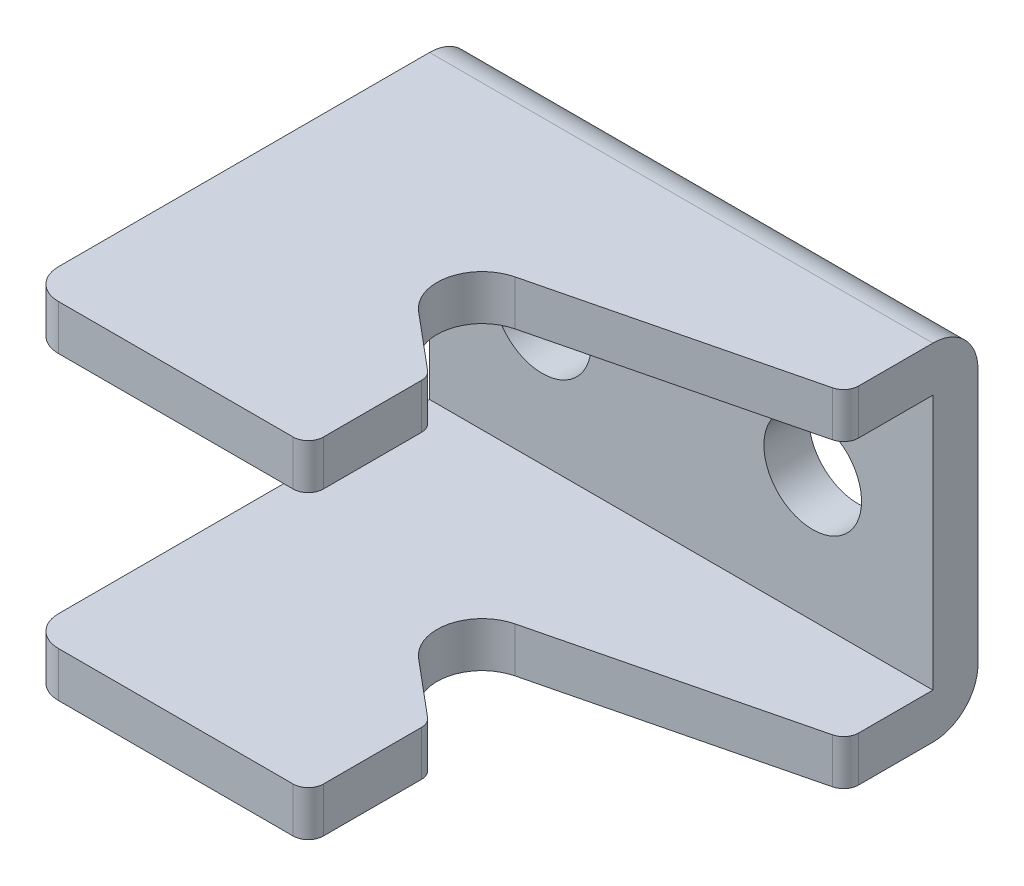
ISO-10303-21;
HEADER;
FILE_DESCRIPTION(('STEP AP214'),'2;1');
FILE_NAME('part.step','',(''),(''),'','','');
FILE_SCHEMA(('AUTOMOTIVE_DESIGN { 1 0 10303 214 1 1 1 1 }'));
ENDSEC;
DATA;
#1=APPLICATION_CONTEXT('core data for automotive mechanical design processes');
#2=APPLICATION_PROTOCOL_DEFINITION('international standard','automotive_design',2000,#1);
#3=PRODUCT_CONTEXT('',#1,'mechanical');
#4=PRODUCT('Part','Part','',(#3));
#5=PRODUCT_RELATED_PRODUCT_CATEGORY('part','',(#4));
#6=PRODUCT_DEFINITION_FORMATION('','',#4);
#7=PRODUCT_DEFINITION_CONTEXT('part definition',#1,'design');
#8=PRODUCT_DEFINITION('design','',#6,#7);
#9=PRODUCT_DEFINITION_SHAPE('','',#8);
#10=(LENGTH_UNIT() NAMED_UNIT(*) SI_UNIT(.MILLI.,.METRE.));
#11=(NAMED_UNIT(*) PLANE_ANGLE_UNIT() SI_UNIT($,.RADIAN.));
#12=(NAMED_UNIT(*) SI_UNIT($,.STERADIAN.) SOLID_ANGLE_UNIT());
#13=UNCERTAINTY_MEASURE_WITH_UNIT(LENGTH_MEASURE(1.E-05),#10,'distance_accuracy_value','');
#14=(GEOMETRIC_REPRESENTATION_CONTEXT(3) GLOBAL_UNCERTAINTY_ASSIGNED_CONTEXT((#13)) GLOBAL_UNIT_ASSIGNED_CONTEXT((#10,
#11,#12)) REPRESENTATION_CONTEXT('',''));
#15=CARTESIAN_POINT('',(0.,0.,0.));
#16=DIRECTION('',(0.,0.,1.));
#17=DIRECTION('',(1.,0.,0.));
#18=AXIS2_PLACEMENT_3D('',#15,#16,#17);
#19=CARTESIAN_POINT('',(80.6300019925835,8.49999999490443,41.0228107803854));
#20=DIRECTION('',(0.,1.,0.));
#21=DIRECTION('',(-1.,0.,0.));
#22=AXIS2_PLACEMENT_3D('',#19,#20,#21);
#23=CYLINDRICAL_SURFACE('',#22,1.);
#24=CARTESIAN_POINT('',(80.6300019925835,11.4999999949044,41.0228107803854));
#25=DIRECTION('',(0.,1.,0.));
#26=DIRECTION('',(-1.,0.,0.));
#27=AXIS2_PLACEMENT_3D('',#24,#25,#26);
#28=CIRCLE('',#27,1.);
#29=CARTESIAN_POINT('',(81.2724011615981,11.4999999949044,40.2564405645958));
#30=VERTEX_POINT('',#29);
#31=CARTESIAN_POINT('',(81.6300019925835,11.4999999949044,41.0228107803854));
#32=VERTEX_POINT('',#31);
#33=EDGE_CURVE('E189',#30,#32,#28,.F.);
#34=ORIENTED_EDGE('',*,*,#33,.T.);
#35=DIRECTION('',(0.,-1.,0.));
#36=VECTOR('',#35,1.);
#37=CARTESIAN_POINT('',(81.6300019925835,8.49999999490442,41.0228107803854));
#38=LINE('',#37,#36);
#39=CARTESIAN_POINT('',(81.6300019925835,8.49999999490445,41.0228107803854));
#40=VERTEX_POINT('',#39);
#41=EDGE_CURVE('E187',#32,#40,#38,.T.);
#42=ORIENTED_EDGE('',*,*,#41,.T.);
#43=CARTESIAN_POINT('',(80.6300019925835,8.49999999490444,41.0228107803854));
#44=DIRECTION('',(0.,1.,0.));
#45=DIRECTION('',(-1.,0.,0.));
#46=AXIS2_PLACEMENT_3D('',#43,#44,#45);
#47=CIRCLE('',#46,1.);
#48=CARTESIAN_POINT('',(81.2724011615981,8.49999999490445,40.2564405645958));
#49=VERTEX_POINT('',#48);
#50=EDGE_CURVE('E17',#40,#49,#47,.T.);
#51=ORIENTED_EDGE('',*,*,#50,.T.);
#52=DIRECTION('',(0.,1.,0.));
#53=VECTOR('',#52,1.);
#54=CARTESIAN_POINT('',(81.2724011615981,8.49999999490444,40.2564405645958));
#55=LINE('',#54,#53);
#56=EDGE_CURVE('E184',#49,#30,#55,.T.);
#57=ORIENTED_EDGE('',*,*,#56,.T.);
#58=EDGE_LOOP('',(#34,#42,#51,#57));
#59=FACE_BOUND('',#58,.T.);
#60=ADVANCED_FACE('F14',(#59),#23,.T.);
#61=CARTESIAN_POINT('',(80.6300019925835,8.49999999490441,47.556194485));
#62=DIRECTION('',(0.,1.,0.));
#63=DIRECTION('',(-1.,0.,0.));
#64=AXIS2_PLACEMENT_3D('',#61,#62,#63);
#65=CYLINDRICAL_SURFACE('',#64,1.);
#66=CARTESIAN_POINT('',(80.6300019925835,11.4999999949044,47.556194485));
#67=DIRECTION('',(0.,1.,0.));
#68=DIRECTION('',(-1.,0.,0.));
#69=AXIS2_PLACEMENT_3D('',#66,#67,#68);
#70=CIRCLE('',#69,1.);
#71=CARTESIAN_POINT('',(81.6300019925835,11.4999999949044,47.556194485));
#72=VERTEX_POINT('',#71);
#73=CARTESIAN_POINT('',(80.6300019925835,11.4999999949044,48.556194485));
#74=VERTEX_POINT('',#73);
#75=EDGE_CURVE('E259',#72,#74,#70,.F.);
#76=ORIENTED_EDGE('',*,*,#75,.T.);
#77=DIRECTION('',(0.,1.,0.));
#78=VECTOR('',#77,1.);
#79=CARTESIAN_POINT('',(80.6300019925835,8.4999999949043,48.556194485));
#80=LINE('',#79,#78);
#81=CARTESIAN_POINT('',(80.6300019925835,8.49999999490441,48.556194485));
#82=VERTEX_POINT('',#81);
#83=EDGE_CURVE('E248',#74,#82,#80,.F.);
#84=ORIENTED_EDGE('',*,*,#83,.T.);
#85=CARTESIAN_POINT('',(80.6300019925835,8.49999999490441,47.556194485));
#86=DIRECTION('',(0.,1.,0.));
#87=DIRECTION('',(-1.,0.,0.));
#88=AXIS2_PLACEMENT_3D('',#85,#86,#87);
#89=CIRCLE('',#88,1.);
#90=CARTESIAN_POINT('',(81.6300019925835,8.49999999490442,47.556194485));
#91=VERTEX_POINT('',#90);
#92=EDGE_CURVE('E324',#82,#91,#89,.T.);
#93=ORIENTED_EDGE('',*,*,#92,.T.);
#94=DIRECTION('',(0.,-1.,0.));
#95=VECTOR('',#94,1.);
#96=CARTESIAN_POINT('',(81.6300019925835,8.49999999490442,47.556194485));
#97=LINE('',#96,#95);
#98=EDGE_CURVE('E252',#91,#72,#97,.F.);
#99=ORIENTED_EDGE('',*,*,#98,.T.);
#100=EDGE_LOOP('',(#76,#84,#93,#99));
#101=FACE_BOUND('',#100,.T.);
#102=ADVANCED_FACE('F335',(#101),#65,.T.);
#103=CARTESIAN_POINT('',(78.7834056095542,8.49999999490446,31.9430364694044));
#104=DIRECTION('',(-0.238865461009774,0.,-0.971052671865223));
#105=DIRECTION('',(-0.971052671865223,0.,0.238865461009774));
#106=AXIS2_PLACEMENT_3D('',#103,#104,#105);
#107=PLANE('',#106);
#108=DIRECTION('',(-0.971052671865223,0.,0.238865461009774));
#109=VECTOR('',#108,1.);
#110=CARTESIAN_POINT('',(95.7388674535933,8.49999999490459,27.7722285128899));
#111=LINE('',#110,#109);
#112=CARTESIAN_POINT('',(95.7388674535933,8.49999999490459,27.7722285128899));
#113=VERTEX_POINT('',#112);
#114=CARTESIAN_POINT('',(78.7834056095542,8.49999999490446,31.9430364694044));
#115=VERTEX_POINT('',#114);
#116=EDGE_CURVE('E208',#113,#115,#111,.T.);
#117=ORIENTED_EDGE('',*,*,#116,.F.);
#118=DIRECTION('',(0.,1.,0.));
#119=VECTOR('',#118,1.);
#120=CARTESIAN_POINT('',(95.7388674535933,8.49999999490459,27.7722285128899));
#121=LINE('',#120,#119);
#122=CARTESIAN_POINT('',(95.7388674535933,11.4999999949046,27.7722285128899));
#123=VERTEX_POINT('',#122);
#124=EDGE_CURVE('E251',#123,#113,#121,.F.);
#125=ORIENTED_EDGE('',*,*,#124,.F.);
#126=DIRECTION('',(-0.971052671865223,0.,0.238865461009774));
#127=VECTOR('',#126,1.);
#128=CARTESIAN_POINT('',(95.7388674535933,11.4999999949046,27.7722285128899));
#129=LINE('',#128,#127);
#130=CARTESIAN_POINT('',(78.7834056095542,11.4999999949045,31.9430364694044));
#131=VERTEX_POINT('',#130);
#132=EDGE_CURVE('E226',#123,#131,#129,.T.);
#133=ORIENTED_EDGE('',*,*,#132,.T.);
#134=DIRECTION('',(0.,1.,0.));
#135=VECTOR('',#134,1.);
#136=CARTESIAN_POINT('',(78.7834056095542,8.49999999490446,31.9430364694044));
#137=LINE('',#136,#135);
#138=EDGE_CURVE('E256',#131,#115,#137,.F.);
#139=ORIENTED_EDGE('',*,*,#138,.T.);
#140=EDGE_LOOP('',(#117,#125,#133,#139));
#141=FACE_BOUND('',#140,.T.);
#142=ADVANCED_FACE('F507',(#141),#107,.F.);
#143=CARTESIAN_POINT('',(79.5000019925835,8.49999999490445,34.856194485));
#144=DIRECTION('',(0.,1.,0.));
#145=DIRECTION('',(-1.,0.,0.));
#146=AXIS2_PLACEMENT_3D('',#143,#144,#145);
#147=CYLINDRICAL_SURFACE('',#146,3.);
#148=ORIENTED_EDGE('',*,*,#138,.F.);
#149=CARTESIAN_POINT('',(79.5000019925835,11.4999999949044,34.856194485));
#150=DIRECTION('',(0.,1.,0.));
#151=DIRECTION('',(-1.,0.,0.));
#152=AXIS2_PLACEMENT_3D('',#149,#150,#151);
#153=CIRCLE('',#152,3.);
#154=CARTESIAN_POINT('',(77.5728044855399,11.4999999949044,37.155305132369));
#155=VERTEX_POINT('',#154);
#156=EDGE_CURVE('E225',#131,#155,#153,.T.);
#157=ORIENTED_EDGE('',*,*,#156,.T.);
#158=DIRECTION('',(0.,1.,0.));
#159=VECTOR('',#158,1.);
#160=CARTESIAN_POINT('',(77.57280448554,8.49999999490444,37.1553051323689));
#161=LINE('',#160,#159);
#162=CARTESIAN_POINT('',(77.57280448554,8.49999999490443,37.1553051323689));
#163=VERTEX_POINT('',#162);
#164=EDGE_CURVE('E198',#155,#163,#161,.F.);
#165=ORIENTED_EDGE('',*,*,#164,.T.);
#166=CARTESIAN_POINT('',(79.5000019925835,8.49999999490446,34.856194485));
#167=DIRECTION('',(0.,1.,0.));
#168=DIRECTION('',(-1.,0.,0.));
#169=AXIS2_PLACEMENT_3D('',#166,#167,#168);
#170=CIRCLE('',#169,3.);
#171=EDGE_CURVE('E203',#115,#163,#170,.T.);
#172=ORIENTED_EDGE('',*,*,#171,.F.);
#173=EDGE_LOOP('',(#148,#157,#165,#172));
#174=FACE_BOUND('',#173,.T.);
#175=ADVANCED_FACE('F510',(#174),#147,.F.);
#176=CARTESIAN_POINT('',(81.2724011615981,8.49999999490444,40.2564405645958));
#177=DIRECTION('',(-0.64239916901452,0.,0.766370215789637));
#178=DIRECTION('',(0.766370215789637,0.,0.64239916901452));
#179=AXIS2_PLACEMENT_3D('',#176,#177,#178);
#180=PLANE('',#179);
#181=DIRECTION('',(0.76637021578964,0.,0.642399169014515));
#182=VECTOR('',#181,1.);
#183=CARTESIAN_POINT('',(77.57280448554,8.49999999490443,37.155305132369));
#184=LINE('',#183,#182);
#185=EDGE_CURVE('E194',#163,#49,#184,.T.);
#186=ORIENTED_EDGE('',*,*,#185,.F.);
#187=ORIENTED_EDGE('',*,*,#164,.F.);
#188=DIRECTION('',(0.766370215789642,0.,0.642399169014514));
#189=VECTOR('',#188,1.);
#190=CARTESIAN_POINT('',(77.5728044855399,11.4999999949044,37.155305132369));
#191=LINE('',#190,#189);
#192=EDGE_CURVE('E197',#155,#30,#191,.T.);
#193=ORIENTED_EDGE('',*,*,#192,.T.);
#194=ORIENTED_EDGE('',*,*,#56,.F.);
#195=EDGE_LOOP('',(#186,#187,#193,#194));
#196=FACE_BOUND('',#195,.T.);
#197=ADVANCED_FACE('F192',(#196),#180,.F.);
#198=CARTESIAN_POINT('',(81.6300019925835,8.49999999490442,47.556194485));
#199=DIRECTION('',(-1.,0.,0.));
#200=DIRECTION('',(0.,-1.,0.));
#201=AXIS2_PLACEMENT_3D('',#198,#199,#200);
#202=PLANE('',#201);
#203=DIRECTION('',(0.,0.,1.));
#204=VECTOR('',#203,1.);
#205=CARTESIAN_POINT('',(81.6300019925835,8.49999999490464,-12.856194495));
#206=LINE('',#205,#204);
#207=EDGE_CURVE('E204',#40,#91,#206,.T.);
#208=ORIENTED_EDGE('',*,*,#207,.F.);
#209=ORIENTED_EDGE('',*,*,#41,.F.);
#210=DIRECTION('',(0.,0.,1.));
#211=VECTOR('',#210,1.);
#212=CARTESIAN_POINT('',(81.6300019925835,11.4999999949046,-12.856194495));
#213=LINE('',#212,#211);
#214=EDGE_CURVE('E221',#32,#72,#213,.T.);
#215=ORIENTED_EDGE('',*,*,#214,.T.);
#216=ORIENTED_EDGE('',*,*,#98,.F.);
#217=EDGE_LOOP('',(#208,#209,#215,#216));
#218=FACE_BOUND('',#217,.T.);
#219=ADVANCED_FACE('F328',(#218),#202,.F.);
#220=CARTESIAN_POINT('',(65.0000019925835,8.4999999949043,48.556194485));
#221=DIRECTION('',(0.,0.,-1.));
#222=DIRECTION('',(0.,1.,0.));
#223=AXIS2_PLACEMENT_3D('',#220,#221,#222);
#224=PLANE('',#223);
#225=DIRECTION('',(1.,0.,0.));
#226=VECTOR('',#225,1.);
#227=CARTESIAN_POINT('',(79.5000019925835,8.49999999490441,48.556194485));
#228=LINE('',#227,#226);
#229=CARTESIAN_POINT('',(65.0000019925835,8.4999999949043,48.556194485));
#230=VERTEX_POINT('',#229);
#231=EDGE_CURVE('E206',#82,#230,#228,.F.);
#232=ORIENTED_EDGE('',*,*,#231,.F.);
#233=ORIENTED_EDGE('',*,*,#83,.F.);
#234=DIRECTION('',(1.,0.,0.));
#235=VECTOR('',#234,1.);
#236=CARTESIAN_POINT('',(79.5000019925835,11.4999999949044,48.556194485));
#237=LINE('',#236,#235);
#238=CARTESIAN_POINT('',(65.0000019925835,11.4999999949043,48.556194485));
#239=VERTEX_POINT('',#238);
#240=EDGE_CURVE('E218',#74,#239,#237,.F.);
#241=ORIENTED_EDGE('',*,*,#240,.T.);
#242=DIRECTION('',(0.,1.,0.));
#243=VECTOR('',#242,1.);
#244=CARTESIAN_POINT('',(65.0000019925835,8.49999999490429,48.556194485));
#245=LINE('',#244,#243);
#246=EDGE_CURVE('E230',#230,#239,#245,.T.);
#247=ORIENTED_EDGE('',*,*,#246,.F.);
#248=EDGE_LOOP('',(#232,#233,#241,#247));
#249=FACE_BOUND('',#248,.T.);
#250=ADVANCED_FACE('F339',(#249),#224,.F.);
#251=CARTESIAN_POINT('',(95.5000019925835,8.49999999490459,26.8011758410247));
#252=DIRECTION('',(0.,1.,0.));
#253=DIRECTION('',(-1.,0.,0.));
#254=AXIS2_PLACEMENT_3D('',#251,#252,#253);
#255=CYLINDRICAL_SURFACE('',#254,1.);
#256=CARTESIAN_POINT('',(95.5000019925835,11.4999999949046,26.8011758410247));
#257=DIRECTION('',(0.,1.,0.));
#258=DIRECTION('',(-1.,0.,0.));
#259=AXIS2_PLACEMENT_3D('',#256,#257,#258);
#260=CIRCLE('',#259,1.);
#261=CARTESIAN_POINT('',(96.5000019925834,11.4999999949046,26.8011758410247));
#262=VERTEX_POINT('',#261);
#263=EDGE_CURVE('E228',#262,#123,#260,.F.);
#264=ORIENTED_EDGE('',*,*,#263,.T.);
#265=ORIENTED_EDGE('',*,*,#124,.T.);
#266=CARTESIAN_POINT('',(95.5000019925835,8.49999999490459,26.8011758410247));
#267=DIRECTION('',(0.,1.,0.));
#268=DIRECTION('',(-1.,0.,0.));
#269=AXIS2_PLACEMENT_3D('',#266,#267,#268);
#270=CIRCLE('',#269,1.);
#271=CARTESIAN_POINT('',(96.5000019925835,8.4999999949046,26.8011758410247));
#272=VERTEX_POINT('',#271);
#273=EDGE_CURVE('E213',#272,#113,#270,.F.);
#274=ORIENTED_EDGE('',*,*,#273,.F.);
#275=DIRECTION('',(0.,-1.,0.));
#276=VECTOR('',#275,1.);
#277=CARTESIAN_POINT('',(96.5000019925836,-8.50000000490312,26.8011758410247));
#278=LINE('',#277,#276);
#279=EDGE_CURVE('E242',#272,#262,#278,.F.);
#280=ORIENTED_EDGE('',*,*,#279,.T.);
#281=EDGE_LOOP('',(#264,#265,#274,#280));
#282=FACE_BOUND('',#281,.T.);
#283=ADVANCED_FACE('F504',(#282),#255,.T.);
#284=CARTESIAN_POINT('',(95.5000019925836,-8.50000000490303,26.8011758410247));
#285=DIRECTION('',(0.,-1.,0.));
#286=DIRECTION('',(1.,0.,0.));
#287=AXIS2_PLACEMENT_3D('',#284,#285,#286);
#288=CYLINDRICAL_SURFACE('',#287,1.);
#289=CARTESIAN_POINT('',(95.5000019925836,-11.500000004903,26.8011758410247));
#290=DIRECTION('',(0.,-1.,0.));
#291=DIRECTION('',(1.,0.,0.));
#292=AXIS2_PLACEMENT_3D('',#289,#290,#291);
#293=CIRCLE('',#292,1.);
#294=CARTESIAN_POINT('',(95.7388674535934,-11.500000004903,27.7722285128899));
#295=VERTEX_POINT('',#294);
#296=CARTESIAN_POINT('',(96.5000019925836,-11.500000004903,26.8011758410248));
#297=VERTEX_POINT('',#296);
#298=EDGE_CURVE('E296',#295,#297,#293,.F.);
#299=ORIENTED_EDGE('',*,*,#298,.T.);
#300=DIRECTION('',(0.,-1.,0.));
#301=VECTOR('',#300,1.);
#302=CARTESIAN_POINT('',(96.5000019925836,-8.50000000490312,26.8011758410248));
#303=LINE('',#302,#301);
#304=CARTESIAN_POINT('',(96.5000019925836,-8.50000000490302,26.8011758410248));
#305=VERTEX_POINT('',#304);
#306=EDGE_CURVE('E368',#297,#305,#303,.F.);
#307=ORIENTED_EDGE('',*,*,#306,.T.);
#308=CARTESIAN_POINT('',(95.5000019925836,-8.50000000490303,26.8011758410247));
#309=DIRECTION('',(0.,-1.,0.));
#310=DIRECTION('',(1.,0.,0.));
#311=AXIS2_PLACEMENT_3D('',#308,#309,#310);
#312=CIRCLE('',#311,1.);
#313=CARTESIAN_POINT('',(95.7388674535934,-8.50000000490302,27.7722285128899));
#314=VERTEX_POINT('',#313);
#315=EDGE_CURVE('E238',#305,#314,#312,.T.);
#316=ORIENTED_EDGE('',*,*,#315,.T.);
#317=DIRECTION('',(0.,1.,0.));
#318=VECTOR('',#317,1.);
#319=CARTESIAN_POINT('',(95.7388674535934,-8.50000000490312,27.7722285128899));
#320=LINE('',#319,#318);
#321=EDGE_CURVE('E243',#314,#295,#320,.F.);
#322=ORIENTED_EDGE('',*,*,#321,.T.);
#323=EDGE_LOOP('',(#299,#307,#316,#322));
#324=FACE_BOUND('',#323,.T.);
#325=ADVANCED_FACE('F448',(#324),#288,.T.);
#326=CARTESIAN_POINT('',(88.5000019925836,-4.99927260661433E-09,21.8561944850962));
#327=DIRECTION('',(0.,0.,1.));
#328=DIRECTION('',(0.,-1.,0.));
#329=AXIS2_PLACEMENT_3D('',#326,#327,#328);
#330=CYLINDRICAL_SURFACE('',#329,3.25);
#331=CARTESIAN_POINT('',(88.5000019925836,-4.99927260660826E-09,18.8561944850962));
#332=DIRECTION('',(0.,0.,1.));
#333=DIRECTION('',(0.,-1.,0.));
#334=AXIS2_PLACEMENT_3D('',#331,#332,#333);
#335=CIRCLE('',#334,3.25);
#336=CARTESIAN_POINT('',(88.5000019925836,-3.25000000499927,18.8561944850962));
#337=VERTEX_POINT('',#336);
#338=EDGE_CURVE('E237',#337,#337,#335,.F.);
#339=ORIENTED_EDGE('',*,*,#338,.T.);
#340=EDGE_LOOP('',(#339));
#341=FACE_BOUND('',#340,.T.);
#342=CARTESIAN_POINT('',(88.5000019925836,-4.99927260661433E-09,21.8561944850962));
#343=DIRECTION('',(0.,0.,1.));
#344=DIRECTION('',(0.,-1.,0.));
#345=AXIS2_PLACEMENT_3D('',#342,#343,#344);
#346=CIRCLE('',#345,3.25);
#347=CARTESIAN_POINT('',(88.5000019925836,-3.25000000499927,21.8561944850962));
#348=VERTEX_POINT('',#347);
#349=EDGE_CURVE('E285',#348,#348,#346,.F.);
#350=ORIENTED_EDGE('',*,*,#349,.F.);
#351=EDGE_LOOP('',(#350));
#352=FACE_BOUND('',#351,.T.);
#353=ADVANCED_FACE('F570',(#341,#352),#330,.F.);
#354=CARTESIAN_POINT('',(70.5000019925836,-4.99940050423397E-09,21.8561944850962));
#355=DIRECTION('',(0.,0.,1.));
#356=DIRECTION('',(0.,-1.,0.));
#357=AXIS2_PLACEMENT_3D('',#354,#355,#356);
#358=CYLINDRICAL_SURFACE('',#357,3.25);
#359=CARTESIAN_POINT('',(70.5000019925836,-4.9994005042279E-09,18.8561944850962));
#360=DIRECTION('',(0.,0.,1.));
#361=DIRECTION('',(0.,-1.,0.));
#362=AXIS2_PLACEMENT_3D('',#359,#360,#361);
#363=CIRCLE('',#362,3.25);
#364=CARTESIAN_POINT('',(70.5000019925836,-3.2500000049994,18.8561944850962));
#365=VERTEX_POINT('',#364);
#366=EDGE_CURVE('E234',#365,#365,#363,.F.);
#367=ORIENTED_EDGE('',*,*,#366,.T.);
#368=EDGE_LOOP('',(#367));
#369=FACE_BOUND('',#368,.T.);
#370=CARTESIAN_POINT('',(70.5000019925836,-4.99940050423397E-09,21.8561944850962));
#371=DIRECTION('',(0.,0.,1.));
#372=DIRECTION('',(0.,-1.,0.));
#373=AXIS2_PLACEMENT_3D('',#370,#371,#372);
#374=CIRCLE('',#373,3.25);
#375=CARTESIAN_POINT('',(70.5000019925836,-3.2500000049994,21.8561944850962));
#376=VERTEX_POINT('',#375);
#377=EDGE_CURVE('E282',#376,#376,#374,.F.);
#378=ORIENTED_EDGE('',*,*,#377,.F.);
#379=EDGE_LOOP('',(#378));
#380=FACE_BOUND('',#379,.T.);
#381=ADVANCED_FACE('F567',(#369,#380),#358,.F.);
#382=CARTESIAN_POINT('',(96.5000019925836,-8.50000000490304,21.8561944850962));
#383=DIRECTION('',(1.,0.,0.));
#384=DIRECTION('',(0.,1.,0.));
#385=AXIS2_PLACEMENT_3D('',#382,#383,#384);
#386=CYLINDRICAL_SURFACE('',#385,3.);
#387=CARTESIAN_POINT('',(96.5000019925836,-8.50000000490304,21.8561944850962));
#388=DIRECTION('',(1.,0.,0.));
#389=DIRECTION('',(0.,1.,0.));
#390=AXIS2_PLACEMENT_3D('',#387,#388,#389);
#391=CIRCLE('',#390,3.);
#392=CARTESIAN_POINT('',(96.5000019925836,-8.50000000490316,18.8561944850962));
#393=VERTEX_POINT('',#392);
#394=CARTESIAN_POINT('',(96.5000019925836,-11.500000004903,21.8561944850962));
#395=VERTEX_POINT('',#394);
#396=EDGE_CURVE('E289',#393,#395,#391,.F.);
#397=ORIENTED_EDGE('',*,*,#396,.T.);
#398=DIRECTION('',(-1.,0.,0.));
#399=VECTOR('',#398,1.);
#400=CARTESIAN_POINT('',(79.5000019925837,-11.5000000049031,21.8561944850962));
#401=LINE('',#400,#399);
#402=CARTESIAN_POINT('',(63.0000019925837,-11.5000000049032,21.8561944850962));
#403=VERTEX_POINT('',#402);
#404=EDGE_CURVE('E303',#395,#403,#401,.T.);
#405=ORIENTED_EDGE('',*,*,#404,.T.);
#406=CARTESIAN_POINT('',(63.0000019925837,-8.50000000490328,21.8561944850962));
#407=DIRECTION('',(1.,0.,0.));
#408=DIRECTION('',(0.,1.,0.));
#409=AXIS2_PLACEMENT_3D('',#406,#407,#408);
#410=CIRCLE('',#409,3.);
#411=CARTESIAN_POINT('',(63.0000019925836,-8.50000000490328,18.8561944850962));
#412=VERTEX_POINT('',#411);
#413=EDGE_CURVE('E280',#403,#412,#410,.T.);
#414=ORIENTED_EDGE('',*,*,#413,.T.);
#415=DIRECTION('',(1.,0.,0.));
#416=VECTOR('',#415,1.);
#417=CARTESIAN_POINT('',(79.5000019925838,-8.50000000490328,18.8561944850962));
#418=LINE('',#417,#416);
#419=EDGE_CURVE('E235',#412,#393,#418,.T.);
#420=ORIENTED_EDGE('',*,*,#419,.T.);
#421=EDGE_LOOP('',(#397,#405,#414,#420));
#422=FACE_BOUND('',#421,.T.);
#423=ADVANCED_FACE('F489',(#422),#386,.T.);
#424=CARTESIAN_POINT('',(79.5000019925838,-23.8561944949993,18.8561944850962));
#425=DIRECTION('',(0.,0.,1.));
#426=DIRECTION('',(0.,-1.,0.));
#427=AXIS2_PLACEMENT_3D('',#424,#425,#426);
#428=PLANE('',#427);
#429=ORIENTED_EDGE('',*,*,#366,.F.);
#430=EDGE_LOOP('',(#429));
#431=FACE_BOUND('',#430,.T.);
#432=ORIENTED_EDGE('',*,*,#338,.F.);
#433=EDGE_LOOP('',(#432));
#434=FACE_BOUND('',#433,.T.);
#435=ORIENTED_EDGE('',*,*,#419,.F.);
#436=DIRECTION('',(0.,1.,0.));
#437=VECTOR('',#436,1.);
#438=CARTESIAN_POINT('',(63.0000019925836,-8.50000000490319,18.8561944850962));
#439=LINE('',#438,#437);
#440=CARTESIAN_POINT('',(63.0000019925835,8.49999999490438,18.8561944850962));
#441=VERTEX_POINT('',#440);
#442=EDGE_CURVE('E279',#412,#441,#439,.T.);
#443=ORIENTED_EDGE('',*,*,#442,.T.);
#444=DIRECTION('',(-1.,0.,0.));
#445=VECTOR('',#444,1.);
#446=CARTESIAN_POINT('',(63.0000019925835,8.49999999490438,18.8561944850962));
#447=LINE('',#446,#445);
#448=CARTESIAN_POINT('',(96.5000019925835,8.49999999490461,18.8561944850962));
#449=VERTEX_POINT('',#448);
#450=EDGE_CURVE('E231',#449,#441,#447,.T.);
#451=ORIENTED_EDGE('',*,*,#450,.F.);
#452=DIRECTION('',(0.,-1.,0.));
#453=VECTOR('',#452,1.);
#454=CARTESIAN_POINT('',(96.5000019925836,-8.50000000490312,18.8561944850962));
#455=LINE('',#454,#453);
#456=EDGE_CURVE('E292',#449,#393,#455,.T.);
#457=ORIENTED_EDGE('',*,*,#456,.T.);
#458=EDGE_LOOP('',(#435,#443,#451,#457));
#459=FACE_BOUND('',#458,.T.);
#460=ADVANCED_FACE('F491',(#431,#434,#459),#428,.F.);
#461=CARTESIAN_POINT('',(63.0000019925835,8.49999999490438,21.8561944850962));
#462=DIRECTION('',(-1.,0.,0.));
#463=DIRECTION('',(0.,-1.,0.));
#464=AXIS2_PLACEMENT_3D('',#461,#462,#463);
#465=CYLINDRICAL_SURFACE('',#464,3.);
#466=CARTESIAN_POINT('',(63.0000019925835,8.49999999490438,21.8561944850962));
#467=DIRECTION('',(-1.,0.,0.));
#468=DIRECTION('',(0.,-1.,0.));
#469=AXIS2_PLACEMENT_3D('',#466,#467,#468);
#470=CIRCLE('',#469,3.);
#471=CARTESIAN_POINT('',(63.0000019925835,11.4999999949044,21.8561944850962));
#472=VERTEX_POINT('',#471);
#473=EDGE_CURVE('E277',#441,#472,#470,.F.);
#474=ORIENTED_EDGE('',*,*,#473,.T.);
#475=DIRECTION('',(1.,0.,0.));
#476=VECTOR('',#475,1.);
#477=CARTESIAN_POINT('',(79.5000019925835,11.4999999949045,21.8561944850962));
#478=LINE('',#477,#476);
#479=CARTESIAN_POINT('',(96.5000019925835,11.4999999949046,21.8561944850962));
#480=VERTEX_POINT('',#479);
#481=EDGE_CURVE('E220',#472,#480,#478,.T.);
#482=ORIENTED_EDGE('',*,*,#481,.T.);
#483=CARTESIAN_POINT('',(96.5000019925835,8.49999999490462,21.8561944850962));
#484=DIRECTION('',(-1.,0.,0.));
#485=DIRECTION('',(0.,-1.,0.));
#486=AXIS2_PLACEMENT_3D('',#483,#484,#485);
#487=CIRCLE('',#486,3.);
#488=EDGE_CURVE('E293',#480,#449,#487,.T.);
#489=ORIENTED_EDGE('',*,*,#488,.T.);
#490=ORIENTED_EDGE('',*,*,#450,.T.);
#491=EDGE_LOOP('',(#474,#482,#489,#490));
#492=FACE_BOUND('',#491,.T.);
#493=ADVANCED_FACE('F497',(#492),#465,.T.);
#494=CARTESIAN_POINT('',(79.5000019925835,11.4999999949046,-12.856194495));
#495=DIRECTION('',(0.,-1.,0.));
#496=DIRECTION('',(1.,0.,0.));
#497=AXIS2_PLACEMENT_3D('',#494,#495,#496);
#498=PLANE('',#497);
#499=DIRECTION('',(0.,0.,1.));
#500=VECTOR('',#499,1.);
#501=CARTESIAN_POINT('',(63.0000019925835,11.4999999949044,46.556194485));
#502=LINE('',#501,#500);
#503=CARTESIAN_POINT('',(63.0000019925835,11.4999999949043,46.556194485));
#504=VERTEX_POINT('',#503);
#505=EDGE_CURVE('E217',#472,#504,#502,.T.);
#506=ORIENTED_EDGE('',*,*,#505,.T.);
#507=CARTESIAN_POINT('',(65.0000019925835,11.4999999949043,46.556194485));
#508=DIRECTION('',(0.,1.,0.));
#509=DIRECTION('',(-1.,0.,0.));
#510=AXIS2_PLACEMENT_3D('',#507,#508,#509);
#511=CIRCLE('',#510,2.);
#512=EDGE_CURVE('E262',#239,#504,#511,.F.);
#513=ORIENTED_EDGE('',*,*,#512,.F.);
#514=ORIENTED_EDGE('',*,*,#240,.F.);
#515=ORIENTED_EDGE('',*,*,#75,.F.);
#516=ORIENTED_EDGE('',*,*,#214,.F.);
#517=ORIENTED_EDGE('',*,*,#33,.F.);
#518=ORIENTED_EDGE('',*,*,#192,.F.);
#519=ORIENTED_EDGE('',*,*,#156,.F.);
#520=ORIENTED_EDGE('',*,*,#132,.F.);
#521=ORIENTED_EDGE('',*,*,#263,.F.);
#522=DIRECTION('',(0.,0.,1.));
#523=VECTOR('',#522,1.);
#524=CARTESIAN_POINT('',(96.5000019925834,11.4999999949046,-4.80117585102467));
#525=LINE('',#524,#523);
#526=EDGE_CURVE('E247',#262,#480,#525,.F.);
#527=ORIENTED_EDGE('',*,*,#526,.T.);
#528=ORIENTED_EDGE('',*,*,#481,.F.);
#529=EDGE_LOOP('',(#506,#513,#514,#515,#516,#517,#518,#519,#520,#521,#527,#528));
#530=FACE_BOUND('',#529,.T.);
#531=ADVANCED_FACE('F330',(#530),#498,.F.);
#532=CARTESIAN_POINT('',(65.0000019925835,8.4999999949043,46.556194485));
#533=DIRECTION('',(0.,1.,0.));
#534=DIRECTION('',(-1.,0.,0.));
#535=AXIS2_PLACEMENT_3D('',#532,#533,#534);
#536=CYLINDRICAL_SURFACE('',#535,2.);
#537=ORIENTED_EDGE('',*,*,#512,.T.);
#538=DIRECTION('',(0.,1.,0.));
#539=VECTOR('',#538,1.);
#540=CARTESIAN_POINT('',(63.0000019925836,-8.50000000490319,46.556194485));
#541=LINE('',#540,#539);
#542=CARTESIAN_POINT('',(63.0000019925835,8.49999999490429,46.556194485));
#543=VERTEX_POINT('',#542);
#544=EDGE_CURVE('E214',#504,#543,#541,.F.);
#545=ORIENTED_EDGE('',*,*,#544,.T.);
#546=CARTESIAN_POINT('',(65.0000019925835,8.4999999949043,46.556194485));
#547=DIRECTION('',(0.,1.,0.));
#548=DIRECTION('',(-1.,0.,0.));
#549=AXIS2_PLACEMENT_3D('',#546,#547,#548);
#550=CIRCLE('',#549,2.);
#551=EDGE_CURVE('E310',#230,#543,#550,.F.);
#552=ORIENTED_EDGE('',*,*,#551,.F.);
#553=ORIENTED_EDGE('',*,*,#246,.T.);
#554=EDGE_LOOP('',(#537,#545,#552,#553));
#555=FACE_BOUND('',#554,.T.);
#556=ADVANCED_FACE('F554',(#555),#536,.T.);
#557=CARTESIAN_POINT('',(79.5000019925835,8.49999999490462,-12.856194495));
#558=DIRECTION('',(0.,-1.,0.));
#559=DIRECTION('',(1.,0.,0.));
#560=AXIS2_PLACEMENT_3D('',#557,#558,#559);
#561=PLANE('',#560);
#562=ORIENTED_EDGE('',*,*,#92,.F.);
#563=ORIENTED_EDGE('',*,*,#231,.T.);
#564=ORIENTED_EDGE('',*,*,#551,.T.);
#565=DIRECTION('',(0.,0.,1.));
#566=VECTOR('',#565,1.);
#567=CARTESIAN_POINT('',(63.0000019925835,8.49999999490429,46.556194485));
#568=LINE('',#567,#566);
#569=CARTESIAN_POINT('',(63.0000019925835,8.4999999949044,21.8561944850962));
#570=VERTEX_POINT('',#569);
#571=EDGE_CURVE('E216',#543,#570,#568,.F.);
#572=ORIENTED_EDGE('',*,*,#571,.T.);
#573=DIRECTION('',(1.,0.,0.));
#574=VECTOR('',#573,1.);
#575=CARTESIAN_POINT('',(79.5000019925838,8.49999999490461,21.8561944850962));
#576=LINE('',#575,#574);
#577=CARTESIAN_POINT('',(96.5000019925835,8.49999999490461,21.8561944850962));
#578=VERTEX_POINT('',#577);
#579=EDGE_CURVE('E288',#578,#570,#576,.F.);
#580=ORIENTED_EDGE('',*,*,#579,.F.);
#581=DIRECTION('',(0.,0.,1.));
#582=VECTOR('',#581,1.);
#583=CARTESIAN_POINT('',(96.5000019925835,8.49999999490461,-4.80117585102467));
#584=LINE('',#583,#582);
#585=EDGE_CURVE('E239',#578,#272,#584,.T.);
#586=ORIENTED_EDGE('',*,*,#585,.T.);
#587=ORIENTED_EDGE('',*,*,#273,.T.);
#588=ORIENTED_EDGE('',*,*,#116,.T.);
#589=ORIENTED_EDGE('',*,*,#171,.T.);
#590=ORIENTED_EDGE('',*,*,#185,.T.);
#591=ORIENTED_EDGE('',*,*,#50,.F.);
#592=ORIENTED_EDGE('',*,*,#207,.T.);
#593=EDGE_LOOP('',(#562,#563,#564,#572,#580,#586,#587,#588,#589,#590,#591,#592));
#594=FACE_BOUND('',#593,.T.);
#595=ADVANCED_FACE('F200',(#594),#561,.T.);
#596=CARTESIAN_POINT('',(80.6300019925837,-8.50000000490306,47.556194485));
#597=DIRECTION('',(0.,-1.,0.));
#598=DIRECTION('',(1.,0.,0.));
#599=AXIS2_PLACEMENT_3D('',#596,#597,#598);
#600=CYLINDRICAL_SURFACE('',#599,1.);
#601=CARTESIAN_POINT('',(80.6300019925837,-11.500000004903,47.556194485));
#602=DIRECTION('',(0.,-1.,0.));
#603=DIRECTION('',(1.,0.,0.));
#604=AXIS2_PLACEMENT_3D('',#601,#602,#603);
#605=CIRCLE('',#604,1.);
#606=CARTESIAN_POINT('',(80.6300019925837,-11.500000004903,48.556194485));
#607=VERTEX_POINT('',#606);
#608=CARTESIAN_POINT('',(81.6300019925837,-11.5000000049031,47.556194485));
#609=VERTEX_POINT('',#608);
#610=EDGE_CURVE('E301',#607,#609,#605,.F.);
#611=ORIENTED_EDGE('',*,*,#610,.T.);
#612=DIRECTION('',(0.,-1.,0.));
#613=VECTOR('',#612,1.);
#614=CARTESIAN_POINT('',(81.6300019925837,-8.50000000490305,47.556194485));
#615=LINE('',#614,#613);
#616=CARTESIAN_POINT('',(81.6300019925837,-8.50000000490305,47.556194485));
#617=VERTEX_POINT('',#616);
#618=EDGE_CURVE('E358',#609,#617,#615,.F.);
#619=ORIENTED_EDGE('',*,*,#618,.T.);
#620=CARTESIAN_POINT('',(80.6300019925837,-8.50000000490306,47.556194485));
#621=DIRECTION('',(0.,-1.,0.));
#622=DIRECTION('',(1.,0.,0.));
#623=AXIS2_PLACEMENT_3D('',#620,#621,#622);
#624=CIRCLE('',#623,1.);
#625=CARTESIAN_POINT('',(80.6300019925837,-8.50000000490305,48.556194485));
#626=VERTEX_POINT('',#625);
#627=EDGE_CURVE('E306',#617,#626,#624,.T.);
#628=ORIENTED_EDGE('',*,*,#627,.T.);
#629=DIRECTION('',(0.,1.,0.));
#630=VECTOR('',#629,1.);
#631=CARTESIAN_POINT('',(80.6300019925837,-8.50000000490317,48.556194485));
#632=LINE('',#631,#630);
#633=EDGE_CURVE('E359',#626,#607,#632,.F.);
#634=ORIENTED_EDGE('',*,*,#633,.T.);
#635=EDGE_LOOP('',(#611,#619,#628,#634));
#636=FACE_BOUND('',#635,.T.);
#637=ADVANCED_FACE('F479',(#636),#600,.T.);
#638=CARTESIAN_POINT('',(80.6300019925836,-8.50000000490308,41.0228107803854));
#639=DIRECTION('',(0.,-1.,0.));
#640=DIRECTION('',(1.,0.,0.));
#641=AXIS2_PLACEMENT_3D('',#638,#639,#640);
#642=CYLINDRICAL_SURFACE('',#641,1.);
#643=CARTESIAN_POINT('',(80.6300019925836,-11.5000000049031,41.0228107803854));
#644=DIRECTION('',(0.,-1.,0.));
#645=DIRECTION('',(1.,0.,0.));
#646=AXIS2_PLACEMENT_3D('',#643,#644,#645);
#647=CIRCLE('',#646,1.);
#648=CARTESIAN_POINT('',(81.6300019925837,-11.5000000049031,41.0228107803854));
#649=VERTEX_POINT('',#648);
#650=CARTESIAN_POINT('',(81.2724011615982,-11.5000000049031,40.2564405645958));
#651=VERTEX_POINT('',#650);
#652=EDGE_CURVE('E299',#649,#651,#647,.F.);
#653=ORIENTED_EDGE('',*,*,#652,.T.);
#654=DIRECTION('',(0.,1.,0.));
#655=VECTOR('',#654,1.);
#656=CARTESIAN_POINT('',(81.2724011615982,-8.50000000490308,40.2564405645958));
#657=LINE('',#656,#655);
#658=CARTESIAN_POINT('',(81.2724011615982,-8.50000000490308,40.2564405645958));
#659=VERTEX_POINT('',#658);
#660=EDGE_CURVE('E364',#651,#659,#657,.T.);
#661=ORIENTED_EDGE('',*,*,#660,.T.);
#662=CARTESIAN_POINT('',(80.6300019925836,-8.50000000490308,41.0228107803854));
#663=DIRECTION('',(0.,-1.,0.));
#664=DIRECTION('',(1.,0.,0.));
#665=AXIS2_PLACEMENT_3D('',#662,#663,#664);
#666=CIRCLE('',#665,1.);
#667=CARTESIAN_POINT('',(81.6300019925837,-8.50000000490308,41.0228107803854));
#668=VERTEX_POINT('',#667);
#669=EDGE_CURVE('E304',#659,#668,#666,.T.);
#670=ORIENTED_EDGE('',*,*,#669,.T.);
#671=DIRECTION('',(0.,-1.,0.));
#672=VECTOR('',#671,1.);
#673=CARTESIAN_POINT('',(81.6300019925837,-8.50000000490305,41.0228107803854));
#674=LINE('',#673,#672);
#675=EDGE_CURVE('E365',#668,#649,#674,.T.);
#676=ORIENTED_EDGE('',*,*,#675,.T.);
#677=EDGE_LOOP('',(#653,#661,#670,#676));
#678=FACE_BOUND('',#677,.T.);
#679=ADVANCED_FACE('F432',(#678),#642,.T.);
#680=CARTESIAN_POINT('',(79.5000019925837,-11.5000000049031,34.856194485));
#681=DIRECTION('',(0.,1.,0.));
#682=DIRECTION('',(-1.,0.,0.));
#683=AXIS2_PLACEMENT_3D('',#680,#681,#682);
#684=PLANE('',#683);
#685=ORIENTED_EDGE('',*,*,#298,.F.);
#686=DIRECTION('',(-0.971052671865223,0.,0.238865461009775));
#687=VECTOR('',#686,1.);
#688=CARTESIAN_POINT('',(78.7834056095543,-11.500000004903,31.9430364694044));
#689=LINE('',#688,#687);
#690=CARTESIAN_POINT('',(78.7834056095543,-11.5000000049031,31.9430364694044));
#691=VERTEX_POINT('',#690);
#692=EDGE_CURVE('E298',#295,#691,#689,.T.);
#693=ORIENTED_EDGE('',*,*,#692,.T.);
#694=CARTESIAN_POINT('',(79.5000019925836,-11.5000000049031,34.856194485));
#695=DIRECTION('',(0.,-1.,0.));
#696=DIRECTION('',(1.,0.,0.));
#697=AXIS2_PLACEMENT_3D('',#694,#695,#696);
#698=CIRCLE('',#697,3.);
#699=CARTESIAN_POINT('',(77.5728044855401,-11.5000000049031,37.1553051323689));
#700=VERTEX_POINT('',#699);
#701=EDGE_CURVE('E269',#691,#700,#698,.F.);
#702=ORIENTED_EDGE('',*,*,#701,.T.);
#703=DIRECTION('',(0.766370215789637,0.,0.64239916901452));
#704=VECTOR('',#703,1.);
#705=CARTESIAN_POINT('',(81.2724011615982,-11.5000000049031,40.2564405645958));
#706=LINE('',#705,#704);
#707=EDGE_CURVE('E361',#700,#651,#706,.T.);
#708=ORIENTED_EDGE('',*,*,#707,.T.);
#709=ORIENTED_EDGE('',*,*,#652,.F.);
#710=DIRECTION('',(0.,0.,1.));
#711=VECTOR('',#710,1.);
#712=CARTESIAN_POINT('',(81.6300019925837,-11.5000000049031,47.556194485));
#713=LINE('',#712,#711);
#714=EDGE_CURVE('E355',#649,#609,#713,.T.);
#715=ORIENTED_EDGE('',*,*,#714,.T.);
#716=ORIENTED_EDGE('',*,*,#610,.F.);
#717=DIRECTION('',(1.,0.,0.));
#718=VECTOR('',#717,1.);
#719=CARTESIAN_POINT('',(65.0000019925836,-11.500000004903,48.556194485));
#720=LINE('',#719,#718);
#721=CARTESIAN_POINT('',(65.0000019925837,-11.5000000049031,48.556194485));
#722=VERTEX_POINT('',#721);
#723=EDGE_CURVE('E275',#607,#722,#720,.F.);
#724=ORIENTED_EDGE('',*,*,#723,.T.);
#725=CARTESIAN_POINT('',(65.0000019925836,-11.5000000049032,46.556194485));
#726=DIRECTION('',(0.,-1.,0.));
#727=DIRECTION('',(1.,0.,0.));
#728=AXIS2_PLACEMENT_3D('',#725,#726,#727);
#729=CIRCLE('',#728,2.);
#730=CARTESIAN_POINT('',(63.0000019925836,-11.5000000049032,46.556194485));
#731=VERTEX_POINT('',#730);
#732=EDGE_CURVE('E272',#731,#722,#729,.F.);
#733=ORIENTED_EDGE('',*,*,#732,.F.);
#734=DIRECTION('',(0.,0.,1.));
#735=VECTOR('',#734,1.);
#736=CARTESIAN_POINT('',(63.0000019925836,-11.5000000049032,46.556194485));
#737=LINE('',#736,#735);
#738=EDGE_CURVE('E391',#731,#403,#737,.F.);
#739=ORIENTED_EDGE('',*,*,#738,.T.);
#740=ORIENTED_EDGE('',*,*,#404,.F.);
#741=DIRECTION('',(0.,0.,1.));
#742=VECTOR('',#741,1.);
#743=CARTESIAN_POINT('',(96.5000019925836,-11.500000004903,-4.80117585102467));
#744=LINE('',#743,#742);
#745=EDGE_CURVE('E291',#395,#297,#744,.T.);
#746=ORIENTED_EDGE('',*,*,#745,.T.);
#747=EDGE_LOOP('',(#685,#693,#702,#708,#709,#715,#716,#724,#733,#739,#740,#746));
#748=FACE_BOUND('',#747,.T.);
#749=ADVANCED_FACE('F436',(#748),#684,.F.);
#750=CARTESIAN_POINT('',(78.7834056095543,-8.50000000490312,31.9430364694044));
#751=DIRECTION('',(-0.238865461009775,0.,-0.971052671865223));
#752=DIRECTION('',(-0.971052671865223,0.,0.238865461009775));
#753=AXIS2_PLACEMENT_3D('',#750,#751,#752);
#754=PLANE('',#753);
#755=DIRECTION('',(0.971052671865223,0.,-0.238865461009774));
#756=VECTOR('',#755,1.);
#757=CARTESIAN_POINT('',(78.7834056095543,-8.50000000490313,31.9430364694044));
#758=LINE('',#757,#756);
#759=CARTESIAN_POINT('',(78.7834056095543,-8.50000000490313,31.9430364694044));
#760=VERTEX_POINT('',#759);
#761=EDGE_CURVE('E410',#760,#314,#758,.T.);
#762=ORIENTED_EDGE('',*,*,#761,.F.);
#763=DIRECTION('',(0.,-1.,0.));
#764=VECTOR('',#763,1.);
#765=CARTESIAN_POINT('',(78.7834056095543,-8.50000000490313,31.9430364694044));
#766=LINE('',#765,#764);
#767=EDGE_CURVE('E271',#760,#691,#766,.T.);
#768=ORIENTED_EDGE('',*,*,#767,.T.);
#769=ORIENTED_EDGE('',*,*,#692,.F.);
#770=ORIENTED_EDGE('',*,*,#321,.F.);
#771=EDGE_LOOP('',(#762,#768,#769,#770));
#772=FACE_BOUND('',#771,.T.);
#773=ADVANCED_FACE('F443',(#772),#754,.F.);
#774=CARTESIAN_POINT('',(96.5000019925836,-8.50000000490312,-4.80117585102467));
#775=DIRECTION('',(-1.,0.,0.));
#776=DIRECTION('',(0.,-1.,0.));
#777=AXIS2_PLACEMENT_3D('',#774,#775,#776);
#778=PLANE('',#777);
#779=ORIENTED_EDGE('',*,*,#306,.F.);
#780=ORIENTED_EDGE('',*,*,#745,.F.);
#781=ORIENTED_EDGE('',*,*,#396,.F.);
#782=ORIENTED_EDGE('',*,*,#456,.F.);
#783=ORIENTED_EDGE('',*,*,#488,.F.);
#784=ORIENTED_EDGE('',*,*,#526,.F.);
#785=ORIENTED_EDGE('',*,*,#279,.F.);
#786=ORIENTED_EDGE('',*,*,#585,.F.);
#787=DIRECTION('',(0.,-1.,0.));
#788=VECTOR('',#787,1.);
#789=CARTESIAN_POINT('',(96.5000019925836,-23.8561944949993,21.8561944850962));
#790=LINE('',#789,#788);
#791=CARTESIAN_POINT('',(96.5000019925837,-8.50000000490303,21.8561944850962));
#792=VERTEX_POINT('',#791);
#793=EDGE_CURVE('E351',#792,#578,#790,.F.);
#794=ORIENTED_EDGE('',*,*,#793,.F.);
#795=DIRECTION('',(0.,0.,1.));
#796=VECTOR('',#795,1.);
#797=CARTESIAN_POINT('',(96.5000019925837,-8.50000000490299,34.856194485));
#798=LINE('',#797,#796);
#799=EDGE_CURVE('E386',#305,#792,#798,.F.);
#800=ORIENTED_EDGE('',*,*,#799,.F.);
#801=EDGE_LOOP('',(#779,#780,#781,#782,#783,#784,#785,#786,#794,#800));
#802=FACE_BOUND('',#801,.T.);
#803=ADVANCED_FACE('F452',(#802),#778,.F.);
#804=CARTESIAN_POINT('',(79.5000019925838,-23.8561944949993,21.8561944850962));
#805=DIRECTION('',(0.,0.,1.));
#806=DIRECTION('',(0.,-1.,0.));
#807=AXIS2_PLACEMENT_3D('',#804,#805,#806);
#808=PLANE('',#807);
#809=ORIENTED_EDGE('',*,*,#377,.T.);
#810=EDGE_LOOP('',(#809));
#811=FACE_BOUND('',#810,.T.);
#812=ORIENTED_EDGE('',*,*,#349,.T.);
#813=EDGE_LOOP('',(#812));
#814=FACE_BOUND('',#813,.T.);
#815=ORIENTED_EDGE('',*,*,#793,.T.);
#816=ORIENTED_EDGE('',*,*,#579,.T.);
#817=DIRECTION('',(0.,1.,0.));
#818=VECTOR('',#817,1.);
#819=CARTESIAN_POINT('',(63.0000019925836,-8.50000000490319,21.8561944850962));
#820=LINE('',#819,#818);
#821=CARTESIAN_POINT('',(63.0000019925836,-8.50000000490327,21.8561944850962));
#822=VERTEX_POINT('',#821);
#823=EDGE_CURVE('E346',#570,#822,#820,.F.);
#824=ORIENTED_EDGE('',*,*,#823,.T.);
#825=DIRECTION('',(-1.,0.,0.));
#826=VECTOR('',#825,1.);
#827=CARTESIAN_POINT('',(79.5000019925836,-8.50000000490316,21.8561944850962));
#828=LINE('',#827,#826);
#829=EDGE_CURVE('E383',#792,#822,#828,.T.);
#830=ORIENTED_EDGE('',*,*,#829,.F.);
#831=EDGE_LOOP('',(#815,#816,#824,#830));
#832=FACE_BOUND('',#831,.T.);
#833=ADVANCED_FACE('F458',(#811,#814,#832),#808,.T.);
#834=CARTESIAN_POINT('',(63.0000019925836,-8.50000000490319,46.556194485));
#835=DIRECTION('',(1.,0.,0.));
#836=DIRECTION('',(0.,1.,0.));
#837=AXIS2_PLACEMENT_3D('',#834,#835,#836);
#838=PLANE('',#837);
#839=DIRECTION('',(0.,-1.,0.));
#840=VECTOR('',#839,1.);
#841=CARTESIAN_POINT('',(63.0000019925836,-8.5000000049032,46.556194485));
#842=LINE('',#841,#840);
#843=CARTESIAN_POINT('',(63.0000019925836,-8.50000000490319,46.556194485));
#844=VERTEX_POINT('',#843);
#845=EDGE_CURVE('E276',#844,#731,#842,.T.);
#846=ORIENTED_EDGE('',*,*,#845,.F.);
#847=DIRECTION('',(0.,0.,1.));
#848=VECTOR('',#847,1.);
#849=CARTESIAN_POINT('',(63.0000019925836,-8.50000000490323,34.856194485));
#850=LINE('',#849,#848);
#851=EDGE_CURVE('E268',#822,#844,#850,.T.);
#852=ORIENTED_EDGE('',*,*,#851,.F.);
#853=ORIENTED_EDGE('',*,*,#823,.F.);
#854=ORIENTED_EDGE('',*,*,#571,.F.);
#855=ORIENTED_EDGE('',*,*,#544,.F.);
#856=ORIENTED_EDGE('',*,*,#505,.F.);
#857=ORIENTED_EDGE('',*,*,#473,.F.);
#858=ORIENTED_EDGE('',*,*,#442,.F.);
#859=ORIENTED_EDGE('',*,*,#413,.F.);
#860=ORIENTED_EDGE('',*,*,#738,.F.);
#861=EDGE_LOOP('',(#846,#852,#853,#854,#855,#856,#857,#858,#859,#860));
#862=FACE_BOUND('',#861,.T.);
#863=ADVANCED_FACE('F466',(#862),#838,.F.);
#864=CARTESIAN_POINT('',(65.0000019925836,-8.50000000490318,46.556194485));
#865=DIRECTION('',(0.,-1.,0.));
#866=DIRECTION('',(1.,0.,0.));
#867=AXIS2_PLACEMENT_3D('',#864,#865,#866);
#868=CYLINDRICAL_SURFACE('',#867,2.);
#869=ORIENTED_EDGE('',*,*,#732,.T.);
#870=DIRECTION('',(0.,1.,0.));
#871=VECTOR('',#870,1.);
#872=CARTESIAN_POINT('',(65.0000019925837,-8.50000000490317,48.556194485));
#873=LINE('',#872,#871);
#874=CARTESIAN_POINT('',(65.0000019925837,-8.50000000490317,48.556194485));
#875=VERTEX_POINT('',#874);
#876=EDGE_CURVE('E354',#722,#875,#873,.T.);
#877=ORIENTED_EDGE('',*,*,#876,.T.);
#878=CARTESIAN_POINT('',(65.0000019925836,-8.50000000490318,46.556194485));
#879=DIRECTION('',(0.,-1.,0.));
#880=DIRECTION('',(1.,0.,0.));
#881=AXIS2_PLACEMENT_3D('',#878,#879,#880);
#882=CIRCLE('',#881,2.);
#883=EDGE_CURVE('E264',#844,#875,#882,.F.);
#884=ORIENTED_EDGE('',*,*,#883,.F.);
#885=ORIENTED_EDGE('',*,*,#845,.T.);
#886=EDGE_LOOP('',(#869,#877,#884,#885));
#887=FACE_BOUND('',#886,.T.);
#888=ADVANCED_FACE('F471',(#887),#868,.T.);
#889=CARTESIAN_POINT('',(65.0000019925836,-8.50000000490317,48.556194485));
#890=DIRECTION('',(0.,0.,-1.));
#891=DIRECTION('',(0.,1.,0.));
#892=AXIS2_PLACEMENT_3D('',#889,#890,#891);
#893=PLANE('',#892);
#894=DIRECTION('',(-1.,0.,0.));
#895=VECTOR('',#894,1.);
#896=CARTESIAN_POINT('',(79.5000019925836,-8.50000000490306,48.556194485));
#897=LINE('',#896,#895);
#898=EDGE_CURVE('E267',#875,#626,#897,.F.);
#899=ORIENTED_EDGE('',*,*,#898,.F.);
#900=ORIENTED_EDGE('',*,*,#876,.F.);
#901=ORIENTED_EDGE('',*,*,#723,.F.);
#902=ORIENTED_EDGE('',*,*,#633,.F.);
#903=EDGE_LOOP('',(#899,#900,#901,#902));
#904=FACE_BOUND('',#903,.T.);
#905=ADVANCED_FACE('F476',(#904),#893,.F.);
#906=CARTESIAN_POINT('',(81.6300019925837,-8.50000000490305,47.556194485));
#907=DIRECTION('',(-1.,0.,0.));
#908=DIRECTION('',(0.,-1.,0.));
#909=AXIS2_PLACEMENT_3D('',#906,#907,#908);
#910=PLANE('',#909);
#911=DIRECTION('',(0.,0.,1.));
#912=VECTOR('',#911,1.);
#913=CARTESIAN_POINT('',(81.6300019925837,-8.50000000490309,34.856194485));
#914=LINE('',#913,#912);
#915=EDGE_CURVE('E423',#617,#668,#914,.F.);
#916=ORIENTED_EDGE('',*,*,#915,.F.);
#917=ORIENTED_EDGE('',*,*,#618,.F.);
#918=ORIENTED_EDGE('',*,*,#714,.F.);
#919=ORIENTED_EDGE('',*,*,#675,.F.);
#920=EDGE_LOOP('',(#916,#917,#918,#919));
#921=FACE_BOUND('',#920,.T.);
#922=ADVANCED_FACE('F483',(#921),#910,.F.);
#923=CARTESIAN_POINT('',(81.2724011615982,-8.50000000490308,40.2564405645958));
#924=DIRECTION('',(-0.64239916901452,0.,0.766370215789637));
#925=DIRECTION('',(0.766370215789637,0.,0.64239916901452));
#926=AXIS2_PLACEMENT_3D('',#923,#924,#925);
#927=PLANE('',#926);
#928=DIRECTION('',(-0.76637021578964,0.,-0.642399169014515));
#929=VECTOR('',#928,1.);
#930=CARTESIAN_POINT('',(81.2724011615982,-8.50000000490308,40.2564405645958));
#931=LINE('',#930,#929);
#932=CARTESIAN_POINT('',(77.5728044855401,-8.50000000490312,37.155305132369));
#933=VERTEX_POINT('',#932);
#934=EDGE_CURVE('E23',#659,#933,#931,.T.);
#935=ORIENTED_EDGE('',*,*,#934,.F.);
#936=ORIENTED_EDGE('',*,*,#660,.F.);
#937=ORIENTED_EDGE('',*,*,#707,.F.);
#938=DIRECTION('',(0.,-1.,0.));
#939=VECTOR('',#938,1.);
#940=CARTESIAN_POINT('',(77.5728044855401,-8.50000000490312,37.155305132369));
#941=LINE('',#940,#939);
#942=EDGE_CURVE('E32',#700,#933,#941,.F.);
#943=ORIENTED_EDGE('',*,*,#942,.T.);
#944=EDGE_LOOP('',(#935,#936,#937,#943));
#945=FACE_BOUND('',#944,.T.);
#946=ADVANCED_FACE('F430',(#945),#927,.F.);
#947=CARTESIAN_POINT('',(79.5000019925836,-8.50000000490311,34.856194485));
#948=DIRECTION('',(0.,-1.,0.));
#949=DIRECTION('',(1.,0.,0.));
#950=AXIS2_PLACEMENT_3D('',#947,#948,#949);
#951=CYLINDRICAL_SURFACE('',#950,3.);
#952=ORIENTED_EDGE('',*,*,#942,.F.);
#953=ORIENTED_EDGE('',*,*,#701,.F.);
#954=ORIENTED_EDGE('',*,*,#767,.F.);
#955=CARTESIAN_POINT('',(79.5000019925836,-8.50000000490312,34.856194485));
#956=DIRECTION('',(0.,-1.,0.));
#957=DIRECTION('',(1.,0.,0.));
#958=AXIS2_PLACEMENT_3D('',#955,#956,#957);
#959=CIRCLE('',#958,3.);
#960=EDGE_CURVE('E9',#933,#760,#959,.T.);
#961=ORIENTED_EDGE('',*,*,#960,.F.);
#962=EDGE_LOOP('',(#952,#953,#954,#961));
#963=FACE_BOUND('',#962,.T.);
#964=ADVANCED_FACE('F441',(#963),#951,.F.);
#965=CARTESIAN_POINT('',(79.5000019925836,-8.50000000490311,34.856194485));
#966=DIRECTION('',(0.,1.,0.));
#967=DIRECTION('',(-1.,0.,0.));
#968=AXIS2_PLACEMENT_3D('',#965,#966,#967);
#969=PLANE('',#968);
#970=ORIENTED_EDGE('',*,*,#934,.T.);
#971=ORIENTED_EDGE('',*,*,#960,.T.);
#972=ORIENTED_EDGE('',*,*,#761,.T.);
#973=ORIENTED_EDGE('',*,*,#315,.F.);
#974=ORIENTED_EDGE('',*,*,#799,.T.);
#975=ORIENTED_EDGE('',*,*,#829,.T.);
#976=ORIENTED_EDGE('',*,*,#851,.T.);
#977=ORIENTED_EDGE('',*,*,#883,.T.);
#978=ORIENTED_EDGE('',*,*,#898,.T.);
#979=ORIENTED_EDGE('',*,*,#627,.F.);
#980=ORIENTED_EDGE('',*,*,#915,.T.);
#981=ORIENTED_EDGE('',*,*,#669,.F.);
#982=EDGE_LOOP('',(#970,#971,#972,#973,#974,#975,#976,#977,#978,#979,#980,#981));
#983=FACE_BOUND('',#982,.T.);
#984=ADVANCED_FACE('F428',(#983),#969,.T.);
#985=CLOSED_SHELL('',(#60,#102,#142,#175,#197,#219,#250,#283,#325,#353,#381,#423,#460,#493,#531,
#556,#595,#637,#679,#749,#773,#803,#833,#863,#888,#905,#922,#946,#964,#984));
#986=MANIFOLD_SOLID_BREP('B1',#985);
#987=ADVANCED_BREP_SHAPE_REPRESENTATION('',(#18,#986),#14);
#988=SHAPE_DEFINITION_REPRESENTATION(#9,#987);
ENDSEC;
END-ISO-10303-21;
